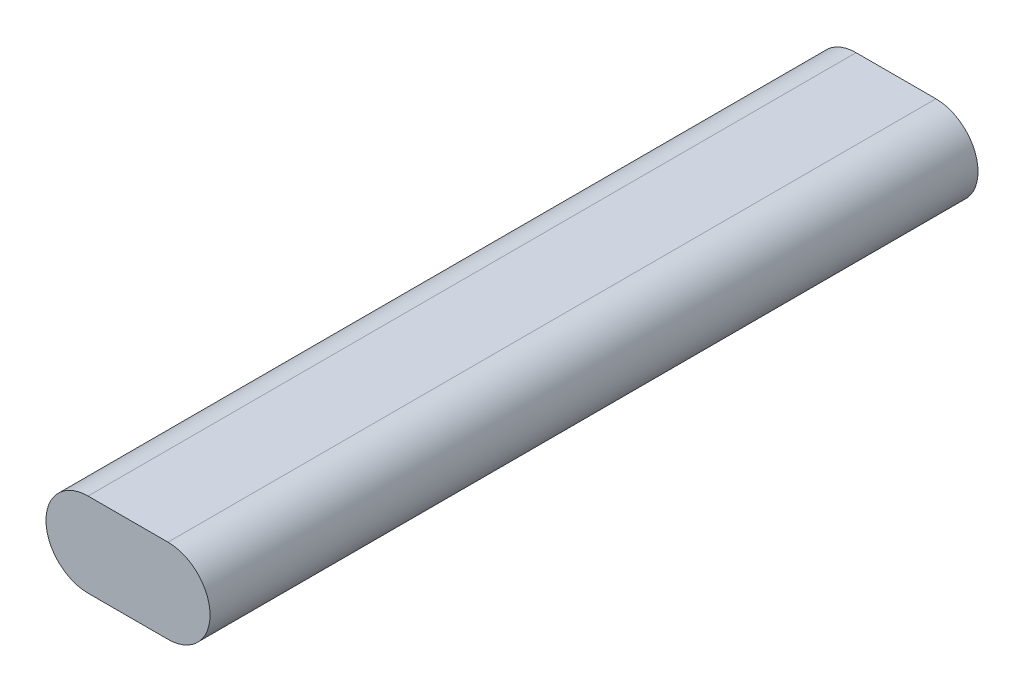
ISO-10303-21;
HEADER;
FILE_DESCRIPTION(('STEP AP214'),'2;1');
FILE_NAME('part.step','',(''),(''),'','','');
FILE_SCHEMA(('AUTOMOTIVE_DESIGN { 1 0 10303 214 1 1 1 1 }'));
ENDSEC;
DATA;
#1=APPLICATION_CONTEXT('core data for automotive mechanical design processes');
#2=APPLICATION_PROTOCOL_DEFINITION('international standard','automotive_design',2000,#1);
#3=PRODUCT_CONTEXT('',#1,'mechanical');
#4=PRODUCT('Part','Part','',(#3));
#5=PRODUCT_RELATED_PRODUCT_CATEGORY('part','',(#4));
#6=PRODUCT_DEFINITION_FORMATION('','',#4);
#7=PRODUCT_DEFINITION_CONTEXT('part definition',#1,'design');
#8=PRODUCT_DEFINITION('design','',#6,#7);
#9=PRODUCT_DEFINITION_SHAPE('','',#8);
#10=(LENGTH_UNIT() NAMED_UNIT(*) SI_UNIT(.MILLI.,.METRE.));
#11=(NAMED_UNIT(*) PLANE_ANGLE_UNIT() SI_UNIT($,.RADIAN.));
#12=(NAMED_UNIT(*) SI_UNIT($,.STERADIAN.) SOLID_ANGLE_UNIT());
#13=UNCERTAINTY_MEASURE_WITH_UNIT(LENGTH_MEASURE(1.E-05),#10,'distance_accuracy_value','');
#14=(GEOMETRIC_REPRESENTATION_CONTEXT(3) GLOBAL_UNCERTAINTY_ASSIGNED_CONTEXT((#13)) GLOBAL_UNIT_ASSIGNED_CONTEXT((#10,
#11,#12)) REPRESENTATION_CONTEXT('',''));
#15=CARTESIAN_POINT('',(0.,0.,0.));
#16=DIRECTION('',(0.,0.,1.));
#17=DIRECTION('',(1.,0.,0.));
#18=AXIS2_PLACEMENT_3D('',#15,#16,#17);
#19=CARTESIAN_POINT('',(0.,0.,317.5));
#20=DIRECTION('',(0.,0.,-1.));
#21=DIRECTION('',(-1.,0.,0.));
#22=AXIS2_PLACEMENT_3D('',#19,#20,#21);
#23=CYLINDRICAL_SURFACE('',#22,17.399);
#24=CARTESIAN_POINT('',(0.,0.,0.));
#25=DIRECTION('',(0.,0.,1.));
#26=DIRECTION('',(1.,0.,0.));
#27=AXIS2_PLACEMENT_3D('',#24,#25,#26);
#28=CIRCLE('',#27,17.399);
#29=CARTESIAN_POINT('',(0.,17.399,0.));
#30=VERTEX_POINT('',#29);
#31=CARTESIAN_POINT('',(0.,-17.399,0.));
#32=VERTEX_POINT('',#31);
#33=EDGE_CURVE('E97',#30,#32,#28,.T.);
#34=ORIENTED_EDGE('',*,*,#33,.T.);
#35=DIRECTION('',(0.,0.,-1.));
#36=VECTOR('',#35,1.);
#37=CARTESIAN_POINT('',(0.,-17.399,317.5));
#38=LINE('',#37,#36);
#39=CARTESIAN_POINT('',(0.,-17.399,317.5));
#40=VERTEX_POINT('',#39);
#41=EDGE_CURVE('E11',#40,#32,#38,.T.);
#42=ORIENTED_EDGE('',*,*,#41,.F.);
#43=CARTESIAN_POINT('',(0.,0.,317.5));
#44=DIRECTION('',(0.,0.,1.));
#45=DIRECTION('',(1.,0.,0.));
#46=AXIS2_PLACEMENT_3D('',#43,#44,#45);
#47=CIRCLE('',#46,17.399);
#48=CARTESIAN_POINT('',(0.,17.399,317.5));
#49=VERTEX_POINT('',#48);
#50=EDGE_CURVE('E85',#49,#40,#47,.T.);
#51=ORIENTED_EDGE('',*,*,#50,.F.);
#52=DIRECTION('',(0.,0.,-1.));
#53=VECTOR('',#52,1.);
#54=CARTESIAN_POINT('',(0.,17.399,317.5));
#55=LINE('',#54,#53);
#56=EDGE_CURVE('E93',#49,#30,#55,.T.);
#57=ORIENTED_EDGE('',*,*,#56,.T.);
#58=EDGE_LOOP('',(#34,#42,#51,#57));
#59=FACE_BOUND('',#58,.T.);
#60=ADVANCED_FACE('F34',(#59),#23,.T.);
#61=CARTESIAN_POINT('',(0.,-17.399,317.5));
#62=DIRECTION('',(0.,1.,0.));
#63=DIRECTION('',(0.,0.,1.));
#64=AXIS2_PLACEMENT_3D('',#61,#62,#63);
#65=PLANE('',#64);
#66=DIRECTION('',(1.,0.,0.));
#67=VECTOR('',#66,1.);
#68=CARTESIAN_POINT('',(0.,-17.399,0.));
#69=LINE('',#68,#67);
#70=CARTESIAN_POINT('',(33.02,-17.399,0.));
#71=VERTEX_POINT('',#70);
#72=EDGE_CURVE('E89',#32,#71,#69,.T.);
#73=ORIENTED_EDGE('',*,*,#72,.T.);
#74=DIRECTION('',(0.,0.,-1.));
#75=VECTOR('',#74,1.);
#76=CARTESIAN_POINT('',(33.02,-17.399,317.5));
#77=LINE('',#76,#75);
#78=CARTESIAN_POINT('',(33.02,-17.399,317.5));
#79=VERTEX_POINT('',#78);
#80=EDGE_CURVE('E42',#79,#71,#77,.T.);
#81=ORIENTED_EDGE('',*,*,#80,.F.);
#82=DIRECTION('',(1.,0.,0.));
#83=VECTOR('',#82,1.);
#84=CARTESIAN_POINT('',(0.,-17.399,317.5));
#85=LINE('',#84,#83);
#86=EDGE_CURVE('E80',#40,#79,#85,.T.);
#87=ORIENTED_EDGE('',*,*,#86,.F.);
#88=ORIENTED_EDGE('',*,*,#41,.T.);
#89=EDGE_LOOP('',(#73,#81,#87,#88));
#90=FACE_BOUND('',#89,.T.);
#91=ADVANCED_FACE('F88',(#90),#65,.F.);
#92=CARTESIAN_POINT('',(33.02,0.,317.5));
#93=DIRECTION('',(0.,0.,-1.));
#94=DIRECTION('',(-1.,0.,0.));
#95=AXIS2_PLACEMENT_3D('',#92,#93,#94);
#96=CYLINDRICAL_SURFACE('',#95,17.399);
#97=CARTESIAN_POINT('',(33.02,0.,0.));
#98=DIRECTION('',(0.,0.,1.));
#99=DIRECTION('',(1.,0.,0.));
#100=AXIS2_PLACEMENT_3D('',#97,#98,#99);
#101=CIRCLE('',#100,17.399);
#102=CARTESIAN_POINT('',(33.02,17.399,0.));
#103=VERTEX_POINT('',#102);
#104=EDGE_CURVE('E67',#71,#103,#101,.T.);
#105=ORIENTED_EDGE('',*,*,#104,.T.);
#106=DIRECTION('',(0.,0.,-1.));
#107=VECTOR('',#106,1.);
#108=CARTESIAN_POINT('',(33.02,17.399,317.5));
#109=LINE('',#108,#107);
#110=CARTESIAN_POINT('',(33.02,17.399,317.5));
#111=VERTEX_POINT('',#110);
#112=EDGE_CURVE('E90',#111,#103,#109,.T.);
#113=ORIENTED_EDGE('',*,*,#112,.F.);
#114=CARTESIAN_POINT('',(33.02,0.,317.5));
#115=DIRECTION('',(0.,0.,1.));
#116=DIRECTION('',(1.,0.,0.));
#117=AXIS2_PLACEMENT_3D('',#114,#115,#116);
#118=CIRCLE('',#117,17.399);
#119=EDGE_CURVE('E83',#79,#111,#118,.T.);
#120=ORIENTED_EDGE('',*,*,#119,.F.);
#121=ORIENTED_EDGE('',*,*,#80,.T.);
#122=EDGE_LOOP('',(#105,#113,#120,#121));
#123=FACE_BOUND('',#122,.T.);
#124=ADVANCED_FACE('F91',(#123),#96,.T.);
#125=CARTESIAN_POINT('',(0.,17.399,317.5));
#126=DIRECTION('',(0.,-1.,0.));
#127=DIRECTION('',(0.,0.,-1.));
#128=AXIS2_PLACEMENT_3D('',#125,#126,#127);
#129=PLANE('',#128);
#130=DIRECTION('',(-1.,0.,0.));
#131=VECTOR('',#130,1.);
#132=CARTESIAN_POINT('',(0.,17.399,0.));
#133=LINE('',#132,#131);
#134=EDGE_CURVE('E73',#103,#30,#133,.T.);
#135=ORIENTED_EDGE('',*,*,#134,.T.);
#136=ORIENTED_EDGE('',*,*,#56,.F.);
#137=DIRECTION('',(-1.,0.,0.));
#138=VECTOR('',#137,1.);
#139=CARTESIAN_POINT('',(0.,17.399,317.5));
#140=LINE('',#139,#138);
#141=EDGE_CURVE('E50',#111,#49,#140,.T.);
#142=ORIENTED_EDGE('',*,*,#141,.F.);
#143=ORIENTED_EDGE('',*,*,#112,.T.);
#144=EDGE_LOOP('',(#135,#136,#142,#143));
#145=FACE_BOUND('',#144,.T.);
#146=ADVANCED_FACE('F104',(#145),#129,.F.);
#147=CARTESIAN_POINT('',(0.,0.,317.5));
#148=DIRECTION('',(0.,0.,1.));
#149=DIRECTION('',(1.,0.,0.));
#150=AXIS2_PLACEMENT_3D('',#147,#148,#149);
#151=PLANE('',#150);
#152=ORIENTED_EDGE('',*,*,#50,.T.);
#153=ORIENTED_EDGE('',*,*,#86,.T.);
#154=ORIENTED_EDGE('',*,*,#119,.T.);
#155=ORIENTED_EDGE('',*,*,#141,.T.);
#156=EDGE_LOOP('',(#152,#153,#154,#155));
#157=FACE_BOUND('',#156,.T.);
#158=ADVANCED_FACE('F81',(#157),#151,.T.);
#159=CARTESIAN_POINT('',(0.,0.,0.));
#160=DIRECTION('',(0.,0.,1.));
#161=DIRECTION('',(1.,0.,0.));
#162=AXIS2_PLACEMENT_3D('',#159,#160,#161);
#163=PLANE('',#162);
#164=ORIENTED_EDGE('',*,*,#33,.F.);
#165=ORIENTED_EDGE('',*,*,#134,.F.);
#166=ORIENTED_EDGE('',*,*,#104,.F.);
#167=ORIENTED_EDGE('',*,*,#72,.F.);
#168=EDGE_LOOP('',(#164,#165,#166,#167));
#169=FACE_BOUND('',#168,.T.);
#170=ADVANCED_FACE('F107',(#169),#163,.F.);
#171=CLOSED_SHELL('',(#60,#91,#124,#146,#158,#170));
#172=MANIFOLD_SOLID_BREP('B2',#171);
#173=ADVANCED_BREP_SHAPE_REPRESENTATION('',(#18,#172),#14);
#174=SHAPE_DEFINITION_REPRESENTATION(#9,#173);
ENDSEC;
END-ISO-10303-21;
